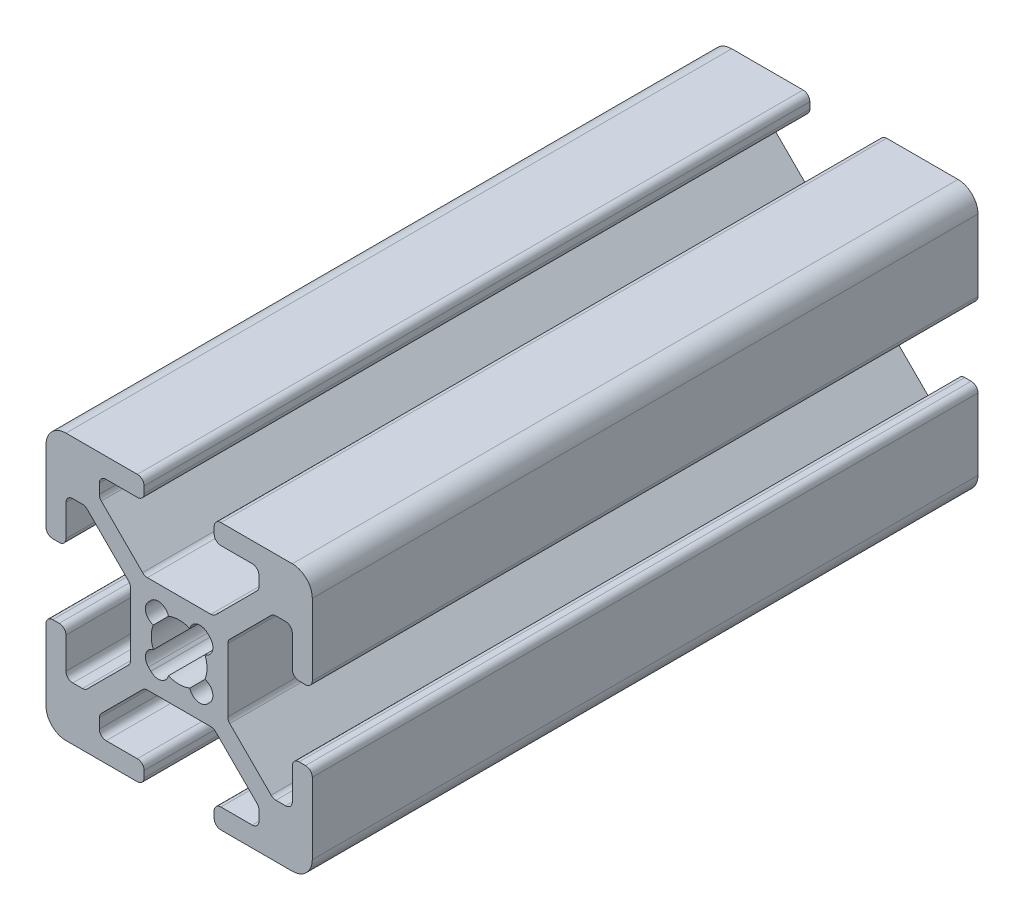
from build123d import *

# Parameters (mm, degrees)
BOSS_EXTRUDE1_DEPTH = 50


with BuildPart() as part:
    # Sketch1 → Boss-Extrude1 (new body)
    with BuildSketch(Plane.XY):
        with BuildLine():
            Line((-5.032287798, -0.341059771), (-5.516287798, -0.341059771))
            ThreePointArc((-5.516287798, -0.341059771), (-5.875498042, -0.192270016), (-6.024287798, 0.166940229))
            Line((-6.024287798, 0.166940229), (-6.024287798, 2.515940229))
            ThreePointArc((-6.024287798, 2.515940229), (-6.173077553, 2.875150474), (-6.532287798, 3.023940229))
            Line((-6.532287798, 3.023940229), (-7.258207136, 3.023940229))
            ThreePointArc((-7.258207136, 3.023940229), (-7.45261032, 2.985271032), (-7.617417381, 2.875150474))
            Line((-7.617417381, 2.875150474), (-10.720498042, -0.227930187))
            ThreePointArc((-10.720498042, -0.227930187), (-10.8306186, -0.392737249), (-10.869287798, -0.587140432))
            Line((-10.869287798, -0.587140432), (-10.869287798, -5.354979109))
            ThreePointArc((-10.869287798, -5.354979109), (-10.8306186, -5.549382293), (-10.720498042, -5.714189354))
            Line((-10.720498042, -5.714189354), (-7.617417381, -8.817270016))
            ThreePointArc((-7.617417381, -8.817270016), (-7.45261032, -8.927390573), (-7.258207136, -8.966059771))
            Line((-7.258207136, -8.966059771), (-6.532287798, -8.966059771))
            ThreePointArc((-6.532287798, -8.966059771), (-6.173077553, -8.817270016), (-6.024287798, -8.458059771))
            Line((-6.024287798, -8.458059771), (-6.024287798, -6.109059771))
            ThreePointArc((-6.024287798, -6.109059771), (-5.875498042, -5.749849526), (-5.516287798, -5.601059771))
            Line((-5.516287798, -5.601059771), (-5.032287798, -5.601059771))
            ThreePointArc((-5.032287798, -5.601059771), (-4.673077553, -5.749849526), (-4.524287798, -6.109059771))
            Line((-4.524287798, -6.109059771), (-4.524287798, -11.471059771))
            ThreePointArc((-4.524287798, -11.471059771), (-4.963627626, -12.531719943), (-6.024287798, -12.971059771))
            Line((-6.024287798, -12.971059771), (-11.386287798, -12.971059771))
            ThreePointArc((-11.386287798, -12.971059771), (-11.745498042, -12.822270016), (-11.894287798, -12.463059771))
            Line((-11.894287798, -12.463059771), (-11.894287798, -11.979059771))
            ThreePointArc((-11.894287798, -11.979059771), (-11.745498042, -11.619849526), (-11.386287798, -11.471059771))
            Line((-11.386287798, -11.471059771), (-9.037287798, -11.471059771))
            ThreePointArc((-9.037287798, -11.471059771), (-8.678077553, -11.322270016), (-8.529287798, -10.963059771))
            Line((-8.529287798, -10.963059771), (-8.529287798, -10.237140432))
            ThreePointArc((-8.529287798, -10.237140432), (-8.567956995, -10.042737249), (-8.678077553, -9.877930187))
            Line((-8.678077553, -9.877930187), (-11.781158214, -6.774849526))
            ThreePointArc((-11.781158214, -6.774849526), (-11.945965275, -6.664728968), (-12.140368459, -6.626059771))
            Line((-12.140368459, -6.626059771), (-16.908207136, -6.626059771))
            ThreePointArc((-16.908207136, -6.626059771), (-17.10261032, -6.664728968), (-17.267417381, -6.774849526))
            Line((-17.267417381, -6.774849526), (-20.370498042, -9.877930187))
            ThreePointArc((-20.370498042, -9.877930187), (-20.4806186, -10.042737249), (-20.519287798, -10.237140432))
            Line((-20.519287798, -10.237140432), (-20.519287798, -10.963059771))
            ThreePointArc((-20.519287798, -10.963059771), (-20.370498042, -11.322270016), (-20.011287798, -11.471059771))
            Line((-20.011287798, -11.471059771), (-17.662287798, -11.471059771))
            ThreePointArc((-17.662287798, -11.471059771), (-17.303077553, -11.619849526), (-17.154287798, -11.979059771))
            Line((-17.154287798, -11.979059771), (-17.154287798, -12.463059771))
            ThreePointArc((-17.154287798, -12.463059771), (-17.303077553, -12.822270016), (-17.662287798, -12.971059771))
            Line((-17.662287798, -12.971059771), (-23.024287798, -12.971059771))
            ThreePointArc((-23.024287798, -12.971059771), (-24.084947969, -12.531719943), (-24.524287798, -11.471059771))
            Line((-24.524287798, -11.471059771), (-24.524287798, -6.109059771))
            ThreePointArc((-24.524287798, -6.109059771), (-24.375498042, -5.749849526), (-24.016287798, -5.601059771))
            Line((-24.016287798, -5.601059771), (-23.532287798, -5.601059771))
            ThreePointArc((-23.532287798, -5.601059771), (-23.173077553, -5.749849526), (-23.024287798, -6.109059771))
            Line((-23.024287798, -6.109059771), (-23.024287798, -8.458059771))
            ThreePointArc((-23.024287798, -8.458059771), (-22.875498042, -8.817270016), (-22.516287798, -8.966059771))
            Line((-22.516287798, -8.966059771), (-21.790368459, -8.966059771))
            ThreePointArc((-21.790368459, -8.966059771), (-21.595965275, -8.927390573), (-21.431158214, -8.817270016))
            Line((-21.431158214, -8.817270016), (-18.328077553, -5.714189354))
            ThreePointArc((-18.328077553, -5.714189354), (-18.217956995, -5.549382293), (-18.179287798, -5.354979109))
            Line((-18.179287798, -5.354979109), (-18.179287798, -0.587140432))
            ThreePointArc((-18.179287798, -0.587140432), (-18.217956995, -0.392737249), (-18.328077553, -0.227930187))
            Line((-18.328077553, -0.227930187), (-21.431158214, 2.875150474))
            ThreePointArc((-21.431158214, 2.875150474), (-21.595965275, 2.985271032), (-21.790368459, 3.023940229))
            Line((-21.790368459, 3.023940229), (-22.516287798, 3.023940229))
            ThreePointArc((-22.516287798, 3.023940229), (-22.875498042, 2.875150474), (-23.024287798, 2.515940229))
            Line((-23.024287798, 2.515940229), (-23.024287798, 0.166940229))
            ThreePointArc((-23.024287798, 0.166940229), (-23.173077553, -0.192270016), (-23.532287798, -0.341059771))
            Line((-23.532287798, -0.341059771), (-24.016287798, -0.341059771))
            ThreePointArc((-24.016287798, -0.341059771), (-24.375498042, -0.192270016), (-24.524287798, 0.166940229))
            Line((-24.524287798, 0.166940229), (-24.524287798, 5.528940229))
            ThreePointArc((-24.524287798, 5.528940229), (-24.084947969, 6.589600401), (-23.024287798, 7.028940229))
            Line((-23.024287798, 7.028940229), (-17.662287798, 7.028940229))
            ThreePointArc((-17.662287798, 7.028940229), (-17.303077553, 6.880150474), (-17.154287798, 6.520940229))
            Line((-17.154287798, 6.520940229), (-17.154287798, 6.036940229))
            ThreePointArc((-17.154287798, 6.036940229), (-17.303077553, 5.677729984), (-17.662287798, 5.528940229))
            Line((-17.662287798, 5.528940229), (-20.011287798, 5.528940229))
            ThreePointArc((-20.011287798, 5.528940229), (-20.370498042, 5.380150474), (-20.519287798, 5.020940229))
            Line((-20.519287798, 5.020940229), (-20.519287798, 4.295020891))
            ThreePointArc((-20.519287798, 4.295020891), (-20.4806186, 4.100617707), (-20.370498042, 3.935810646))
            Line((-20.370498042, 3.935810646), (-17.267417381, 0.832729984))
            ThreePointArc((-17.267417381, 0.832729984), (-17.10261032, 0.722609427), (-16.908207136, 0.683940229))
            Line((-16.908207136, 0.683940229), (-12.140368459, 0.683940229))
            ThreePointArc((-12.140368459, 0.683940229), (-11.945965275, 0.722609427), (-11.781158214, 0.832729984))
            Line((-11.781158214, 0.832729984), (-8.678077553, 3.935810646))
            ThreePointArc((-8.678077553, 3.935810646), (-8.567956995, 4.100617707), (-8.529287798, 4.295020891))
            Line((-8.529287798, 4.295020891), (-8.529287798, 5.020940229))
            ThreePointArc((-8.529287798, 5.020940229), (-8.678077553, 5.380150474), (-9.037287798, 5.528940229))
            Line((-9.037287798, 5.528940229), (-11.386287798, 5.528940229))
            ThreePointArc((-11.386287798, 5.528940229), (-11.745498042, 5.677729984), (-11.894287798, 6.036940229))
            Line((-11.894287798, 6.036940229), (-11.894287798, 6.520940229))
            ThreePointArc((-11.894287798, 6.520940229), (-11.745498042, 6.880150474), (-11.386287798, 7.028940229))
            Line((-11.386287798, 7.028940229), (-6.024287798, 7.028940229))
            ThreePointArc((-6.024287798, 7.028940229), (-4.963627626, 6.589600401), (-4.524287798, 5.528940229))
            Line((-4.524287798, 5.528940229), (-4.524287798, 0.166940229))
            ThreePointArc((-4.524287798, 0.166940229), (-4.673077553, -0.192270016), (-5.032287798, -0.341059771))
        make_face()
        with BuildLine():
            Line((-12.399386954, -5.275565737), (-12.219781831, -5.095960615))
            ThreePointArc((-12.219781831, -5.095960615), (-12.018349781, -4.327527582), (-12.589154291, -3.775036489))
            ThreePointArc((-12.589154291, -3.775036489), (-12.428787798, -2.971059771), (-12.589154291, -2.167083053))
            ThreePointArc((-12.589154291, -2.167083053), (-12.018349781, -1.61459196), (-12.219781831, -0.846158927))
            Line((-12.219781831, -0.846158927), (-12.399386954, -0.666553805))
            ThreePointArc((-12.399386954, -0.666553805), (-13.167819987, -0.465121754), (-13.72031108, -1.035926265))
            ThreePointArc((-13.72031108, -1.035926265), (-14.524287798, -0.875559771), (-15.328264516, -1.035926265))
            ThreePointArc((-15.328264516, -1.035926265), (-15.880755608, -0.465121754), (-16.649188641, -0.666553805))
            Line((-16.649188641, -0.666553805), (-16.828793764, -0.846158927))
            ThreePointArc((-16.828793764, -0.846158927), (-17.030225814, -1.61459196), (-16.459421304, -2.167083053))
            ThreePointArc((-16.459421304, -2.167083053), (-16.619787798, -2.971059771), (-16.459421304, -3.775036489))
            ThreePointArc((-16.459421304, -3.775036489), (-17.030225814, -4.327527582), (-16.828793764, -5.095960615))
            Line((-16.828793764, -5.095960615), (-16.649188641, -5.275565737))
            ThreePointArc((-16.649188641, -5.275565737), (-15.880755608, -5.476997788), (-15.328264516, -4.906193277))
            ThreePointArc((-15.328264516, -4.906193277), (-14.524287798, -5.066559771), (-13.72031108, -4.906193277))
            ThreePointArc((-13.72031108, -4.906193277), (-13.167819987, -5.476997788), (-12.399386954, -5.275565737))
        make_face(mode=Mode.SUBTRACT)
    extrude(amount=BOSS_EXTRUDE1_DEPTH)


solid = part.part
